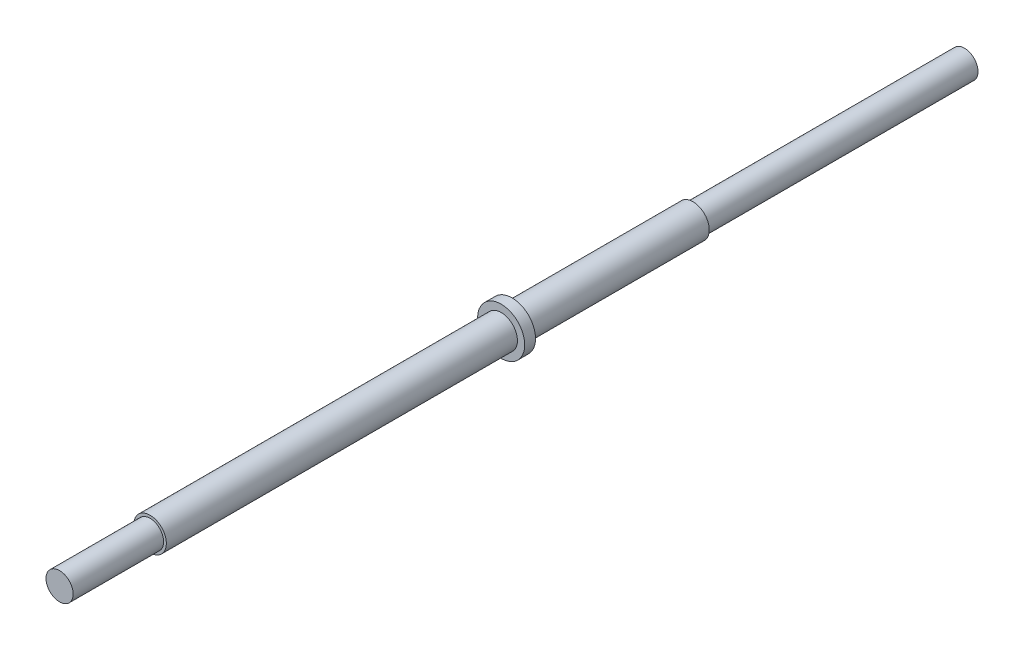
from build123d import *

# Parameters (mm, degrees)
SKETCH1_R           = 4.5
BOSS_EXTRUDE1_DEPTH = 250
SKETCH5_W           = 0.75
SKETCH5_H           = 75
SKETCH13_W          = 3
SKETCH13_H          = 2
SKETCH14_W          = 0.75
SKETCH14_H          = 25


with BuildPart() as part:
    # Sketch1 → Boss-Extrude1 (new body)
    with BuildSketch(Plane.XY):
        Circle(SKETCH1_R)
    extrude(amount=BOSS_EXTRUDE1_DEPTH)

    # Sketch5 → Cut-Revolve1 (revolve, cut)
    with BuildSketch(Plane(origin=(0, 0, 0), x_dir=(1, 0, 0), z_dir=(0, 1, 0)), mode=Mode.PRIVATE) as cut_revolve1_sk:
        with Locations((4.125, -37.5)):
            Rectangle(SKETCH5_W, SKETCH5_H)
    revolve(cut_revolve1_sk.sketch.rotate(Axis((0, 0, 0), (0, 0, 1)), 180), axis=Axis((0, 0, 0), (0, 0, 1)), mode=Mode.SUBTRACT)

    # Sketch14 → Cut-Revolve2 (revolve, cut)
    with BuildSketch(Plane(origin=(0, 0, 0), x_dir=(1, 0, 0), z_dir=(0, 1, 0)), mode=Mode.PRIVATE) as cut_revolve2_sk:
        with Locations((4.125, -237.5)):
            Rectangle(SKETCH14_W, SKETCH14_H)
    revolve(cut_revolve2_sk.sketch.rotate(Axis((0, 0, 0), (0, 0, 1)), 180), axis=Axis((0, 0, 0), (0, 0, 1)), mode=Mode.SUBTRACT)


with BuildPart() as body_2:
    # Sketch13 → Revolve2 (revolve)
    with BuildSketch(Plane(origin=(0, 0, 0), x_dir=(0, 0, -1), z_dir=(1, 0, 0)), mode=Mode.PRIVATE) as revolve2_sk:
        with Locations((-126.5, 5.500488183)):
            Rectangle(SKETCH13_W, SKETCH13_H)
    revolve(revolve2_sk.sketch.rotate(Axis((0, 0, 0), (0, 0, 1)), 90), axis=Axis((0, 0, 0), (0, 0, 1)))


solid = Compound([part.part, body_2.part])
